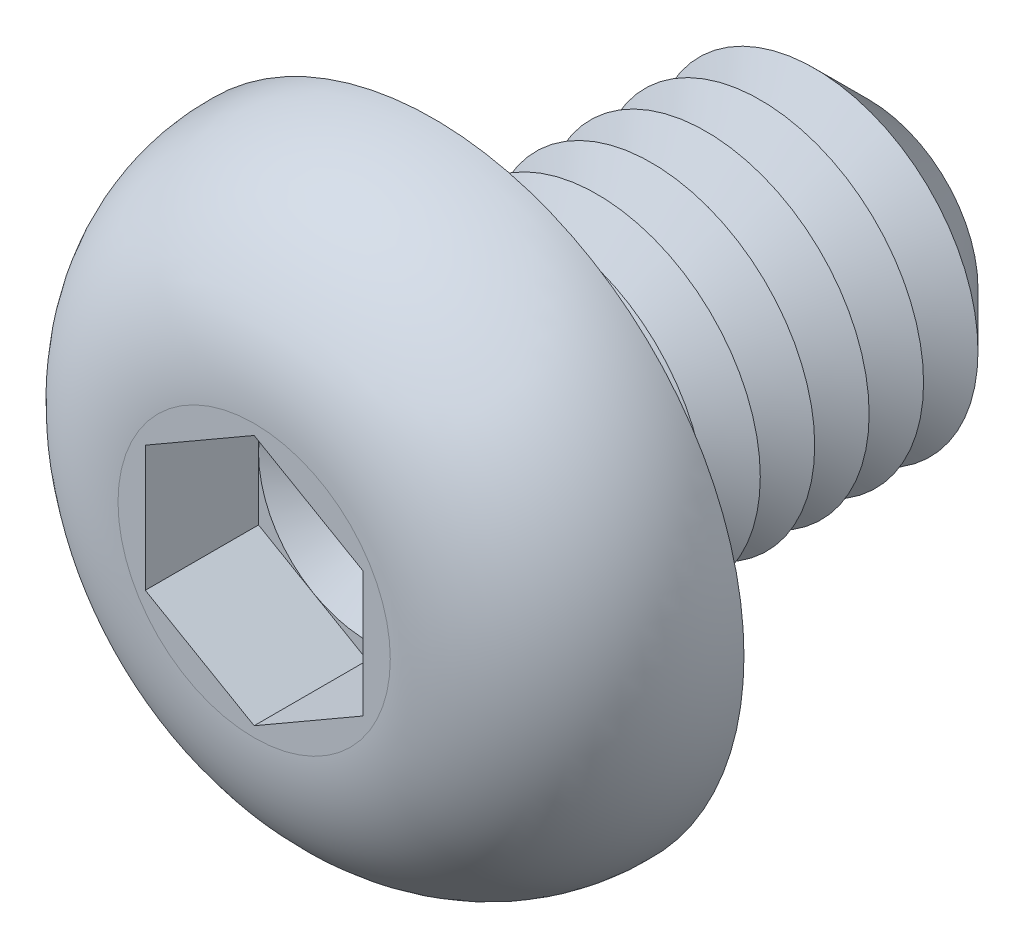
ISO-10303-21;
HEADER;
FILE_DESCRIPTION(('STEP AP214'),'2;1');
FILE_NAME('part.step','',(''),(''),'','','');
FILE_SCHEMA(('AUTOMOTIVE_DESIGN { 1 0 10303 214 1 1 1 1 }'));
ENDSEC;
DATA;
#1=APPLICATION_CONTEXT('core data for automotive mechanical design processes');
#2=APPLICATION_PROTOCOL_DEFINITION('international standard','automotive_design',2000,#1);
#3=PRODUCT_CONTEXT('',#1,'mechanical');
#4=PRODUCT('Part','Part','',(#3));
#5=PRODUCT_RELATED_PRODUCT_CATEGORY('part','',(#4));
#6=PRODUCT_DEFINITION_FORMATION('','',#4);
#7=PRODUCT_DEFINITION_CONTEXT('part definition',#1,'design');
#8=PRODUCT_DEFINITION('design','',#6,#7);
#9=PRODUCT_DEFINITION_SHAPE('','',#8);
#10=(LENGTH_UNIT() NAMED_UNIT(*) SI_UNIT(.MILLI.,.METRE.));
#11=(NAMED_UNIT(*) PLANE_ANGLE_UNIT() SI_UNIT($,.RADIAN.));
#12=(NAMED_UNIT(*) SI_UNIT($,.STERADIAN.) SOLID_ANGLE_UNIT());
#13=UNCERTAINTY_MEASURE_WITH_UNIT(LENGTH_MEASURE(1.E-05),#10,'distance_accuracy_value','');
#14=(GEOMETRIC_REPRESENTATION_CONTEXT(3) GLOBAL_UNCERTAINTY_ASSIGNED_CONTEXT((#13)) GLOBAL_UNIT_ASSIGNED_CONTEXT((#10,
#11,#12)) REPRESENTATION_CONTEXT('',''));
#15=CARTESIAN_POINT('',(0.,0.,0.));
#16=DIRECTION('',(0.,0.,1.));
#17=DIRECTION('',(1.,0.,0.));
#18=AXIS2_PLACEMENT_3D('',#15,#16,#17);
#19=CARTESIAN_POINT('',(0.,0.,0.61));
#20=DIRECTION('',(0.,0.,1.));
#21=DIRECTION('',(1.,0.,0.));
#22=AXIS2_PLACEMENT_3D('',#19,#20,#21);
#23=PLANE('',#22);
#24=CARTESIAN_POINT('',(0.,0.,0.61));
#25=DIRECTION('',(0.,0.,1.));
#26=DIRECTION('',(1.,0.,0.));
#27=AXIS2_PLACEMENT_3D('',#24,#25,#26);
#28=CIRCLE('',#27,1.);
#29=CARTESIAN_POINT('',(1.,0.,0.61));
#30=VERTEX_POINT('',#29);
#31=CARTESIAN_POINT('',(0.5,0.866025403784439,0.61));
#32=VERTEX_POINT('',#31);
#33=EDGE_CURVE('E117',#30,#32,#28,.T.);
#34=ORIENTED_EDGE('',*,*,#33,.F.);
#35=DIRECTION('',(0.,1.,0.));
#36=VECTOR('',#35,1.);
#37=CARTESIAN_POINT('',(1.,-0.577350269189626,0.61));
#38=LINE('',#37,#36);
#39=CARTESIAN_POINT('',(1.,0.577350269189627,0.61));
#40=VERTEX_POINT('',#39);
#41=EDGE_CURVE('E140',#30,#40,#38,.T.);
#42=ORIENTED_EDGE('',*,*,#41,.T.);
#43=DIRECTION('',(-0.866025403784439,0.5,0.));
#44=VECTOR('',#43,1.);
#45=CARTESIAN_POINT('',(1.,0.577350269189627,0.61));
#46=LINE('',#45,#44);
#47=EDGE_CURVE('E135',#40,#32,#46,.T.);
#48=ORIENTED_EDGE('',*,*,#47,.T.);
#49=EDGE_LOOP('',(#34,#42,#48));
#50=FACE_BOUND('',#49,.T.);
#51=ADVANCED_FACE('F39',(#50),#23,.T.);
#52=CARTESIAN_POINT('',(0.,0.,0.61));
#53=DIRECTION('',(0.,0.,1.));
#54=DIRECTION('',(1.,0.,0.));
#55=AXIS2_PLACEMENT_3D('',#52,#53,#54);
#56=CIRCLE('',#55,1.);
#57=CARTESIAN_POINT('',(-0.5,0.866025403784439,0.61));
#58=VERTEX_POINT('',#57);
#59=EDGE_CURVE('E11',#32,#58,#56,.T.);
#60=ORIENTED_EDGE('',*,*,#59,.F.);
#61=CARTESIAN_POINT('',(0.,1.15470053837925,0.61));
#62=VERTEX_POINT('',#61);
#63=EDGE_CURVE('E130',#32,#62,#46,.T.);
#64=ORIENTED_EDGE('',*,*,#63,.T.);
#65=DIRECTION('',(-0.866025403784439,-0.5,0.));
#66=VECTOR('',#65,1.);
#67=CARTESIAN_POINT('',(0.,1.15470053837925,0.61));
#68=LINE('',#67,#66);
#69=EDGE_CURVE('E132',#62,#58,#68,.T.);
#70=ORIENTED_EDGE('',*,*,#69,.T.);
#71=EDGE_LOOP('',(#60,#64,#70));
#72=FACE_BOUND('',#71,.T.);
#73=ADVANCED_FACE('F129',(#72),#23,.T.);
#74=CARTESIAN_POINT('',(-1.,0.,0.61));
#75=VERTEX_POINT('',#74);
#76=EDGE_CURVE('E49',#58,#75,#56,.T.);
#77=ORIENTED_EDGE('',*,*,#76,.F.);
#78=CARTESIAN_POINT('',(-1.,0.577350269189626,0.61));
#79=VERTEX_POINT('',#78);
#80=EDGE_CURVE('E143',#58,#79,#68,.T.);
#81=ORIENTED_EDGE('',*,*,#80,.T.);
#82=DIRECTION('',(0.,-1.,0.));
#83=VECTOR('',#82,1.);
#84=CARTESIAN_POINT('',(-1.,0.577350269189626,0.61));
#85=LINE('',#84,#83);
#86=EDGE_CURVE('E153',#79,#75,#85,.T.);
#87=ORIENTED_EDGE('',*,*,#86,.T.);
#88=EDGE_LOOP('',(#77,#81,#87));
#89=FACE_BOUND('',#88,.T.);
#90=ADVANCED_FACE('F248',(#89),#23,.T.);
#91=CARTESIAN_POINT('',(-0.5,-0.866025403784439,0.61));
#92=VERTEX_POINT('',#91);
#93=EDGE_CURVE('E232',#75,#92,#56,.T.);
#94=ORIENTED_EDGE('',*,*,#93,.F.);
#95=CARTESIAN_POINT('',(-1.,-0.577350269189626,0.61));
#96=VERTEX_POINT('',#95);
#97=EDGE_CURVE('E152',#75,#96,#85,.T.);
#98=ORIENTED_EDGE('',*,*,#97,.T.);
#99=DIRECTION('',(0.866025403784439,-0.5,0.));
#100=VECTOR('',#99,1.);
#101=CARTESIAN_POINT('',(-1.,-0.577350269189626,0.61));
#102=LINE('',#101,#100);
#103=EDGE_CURVE('E158',#96,#92,#102,.T.);
#104=ORIENTED_EDGE('',*,*,#103,.T.);
#105=EDGE_LOOP('',(#94,#98,#104));
#106=FACE_BOUND('',#105,.T.);
#107=ADVANCED_FACE('F241',(#106),#23,.T.);
#108=CARTESIAN_POINT('',(0.5,-0.866025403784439,0.61));
#109=VERTEX_POINT('',#108);
#110=EDGE_CURVE('E56',#92,#109,#56,.T.);
#111=ORIENTED_EDGE('',*,*,#110,.F.);
#112=CARTESIAN_POINT('',(0.,-1.15470053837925,0.61));
#113=VERTEX_POINT('',#112);
#114=EDGE_CURVE('E157',#92,#113,#102,.T.);
#115=ORIENTED_EDGE('',*,*,#114,.T.);
#116=DIRECTION('',(0.866025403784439,0.5,0.));
#117=VECTOR('',#116,1.);
#118=CARTESIAN_POINT('',(0.,-1.15470053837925,0.61));
#119=LINE('',#118,#117);
#120=EDGE_CURVE('E163',#113,#109,#119,.T.);
#121=ORIENTED_EDGE('',*,*,#120,.T.);
#122=EDGE_LOOP('',(#111,#115,#121));
#123=FACE_BOUND('',#122,.T.);
#124=ADVANCED_FACE('F320',(#123),#23,.T.);
#125=CARTESIAN_POINT('',(0.,0.,-4.));
#126=DIRECTION('',(0.,0.,1.));
#127=DIRECTION('',(1.,0.,0.));
#128=AXIS2_PLACEMENT_3D('',#125,#126,#127);
#129=CYLINDRICAL_SURFACE('',#128,1.5);
#130=CARTESIAN_POINT('',(0.,0.,-0.2));
#131=DIRECTION('',(0.,0.,1.));
#132=DIRECTION('',(1.,0.,0.));
#133=AXIS2_PLACEMENT_3D('',#130,#131,#132);
#134=CIRCLE('',#133,1.5);
#135=CARTESIAN_POINT('',(1.5,0.,-0.2));
#136=VERTEX_POINT('',#135);
#137=EDGE_CURVE('E221',#136,#136,#134,.F.);
#138=ORIENTED_EDGE('',*,*,#137,.T.);
#139=EDGE_LOOP('',(#138));
#140=FACE_BOUND('',#139,.T.);
#141=CARTESIAN_POINT('',(0.,0.,-0.5));
#142=DIRECTION('',(0.,0.,1.));
#143=DIRECTION('',(1.,0.,0.));
#144=AXIS2_PLACEMENT_3D('',#141,#142,#143);
#145=CIRCLE('',#144,1.50000000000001);
#146=CARTESIAN_POINT('',(1.50000000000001,0.,-0.5));
#147=VERTEX_POINT('',#146);
#148=EDGE_CURVE('E149',#147,#147,#145,.T.);
#149=ORIENTED_EDGE('',*,*,#148,.T.);
#150=EDGE_LOOP('',(#149));
#151=FACE_BOUND('',#150,.T.);
#152=ADVANCED_FACE('F304',(#140,#151),#129,.T.);
#153=CARTESIAN_POINT('',(0.,2.85,0.));
#154=DIRECTION('',(0.,0.,1.));
#155=DIRECTION('',(1.,0.,0.));
#156=AXIS2_PLACEMENT_3D('',#153,#154,#155);
#157=PLANE('',#156);
#158=CARTESIAN_POINT('',(0.,0.,0.));
#159=DIRECTION('',(0.,0.,1.));
#160=DIRECTION('',(1.,0.,0.));
#161=AXIS2_PLACEMENT_3D('',#158,#159,#160);
#162=CIRCLE('',#161,1.7);
#163=CARTESIAN_POINT('',(1.7,0.,0.));
#164=VERTEX_POINT('',#163);
#165=EDGE_CURVE('E224',#164,#164,#162,.T.);
#166=ORIENTED_EDGE('',*,*,#165,.T.);
#167=EDGE_LOOP('',(#166));
#168=FACE_BOUND('',#167,.T.);
#169=CARTESIAN_POINT('',(0.,0.,0.));
#170=DIRECTION('',(0.,0.,1.));
#171=DIRECTION('',(1.,0.,0.));
#172=AXIS2_PLACEMENT_3D('',#169,#170,#171);
#173=CIRCLE('',#172,2.85);
#174=CARTESIAN_POINT('',(2.85,0.,0.));
#175=VERTEX_POINT('',#174);
#176=EDGE_CURVE('E195',#175,#175,#173,.T.);
#177=ORIENTED_EDGE('',*,*,#176,.F.);
#178=EDGE_LOOP('',(#177));
#179=FACE_BOUND('',#178,.T.);
#180=ADVANCED_FACE('F350',(#168,#179),#157,.F.);
#181=CARTESIAN_POINT('',(0.,0.,1.65));
#182=DIRECTION('',(0.,0.,-1.));
#183=DIRECTION('',(-1.,0.,0.));
#184=AXIS2_PLACEMENT_3D('',#181,#182,#183);
#185=PLANE('',#184);
#186=DIRECTION('',(-0.866025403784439,-0.5,0.));
#187=VECTOR('',#186,1.);
#188=CARTESIAN_POINT('',(0.,1.15470053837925,1.65));
#189=LINE('',#188,#187);
#190=CARTESIAN_POINT('',(0.,1.15470053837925,1.65));
#191=VERTEX_POINT('',#190);
#192=CARTESIAN_POINT('',(-1.,0.577350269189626,1.65));
#193=VERTEX_POINT('',#192);
#194=EDGE_CURVE('E173',#191,#193,#189,.T.);
#195=ORIENTED_EDGE('',*,*,#194,.F.);
#196=DIRECTION('',(-0.866025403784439,0.5,0.));
#197=VECTOR('',#196,1.);
#198=CARTESIAN_POINT('',(1.,0.577350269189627,1.65));
#199=LINE('',#198,#197);
#200=CARTESIAN_POINT('',(1.,0.577350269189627,1.65));
#201=VERTEX_POINT('',#200);
#202=EDGE_CURVE('E64',#201,#191,#199,.T.);
#203=ORIENTED_EDGE('',*,*,#202,.F.);
#204=DIRECTION('',(0.,1.,0.));
#205=VECTOR('',#204,1.);
#206=CARTESIAN_POINT('',(1.,-0.577350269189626,1.65));
#207=LINE('',#206,#205);
#208=CARTESIAN_POINT('',(1.,-0.577350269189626,1.65));
#209=VERTEX_POINT('',#208);
#210=EDGE_CURVE('E138',#209,#201,#207,.T.);
#211=ORIENTED_EDGE('',*,*,#210,.F.);
#212=DIRECTION('',(0.866025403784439,0.5,0.));
#213=VECTOR('',#212,1.);
#214=CARTESIAN_POINT('',(0.,-1.15470053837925,1.65));
#215=LINE('',#214,#213);
#216=CARTESIAN_POINT('',(0.,-1.15470053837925,1.65));
#217=VERTEX_POINT('',#216);
#218=EDGE_CURVE('E185',#217,#209,#215,.T.);
#219=ORIENTED_EDGE('',*,*,#218,.F.);
#220=DIRECTION('',(0.866025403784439,-0.5,0.));
#221=VECTOR('',#220,1.);
#222=CARTESIAN_POINT('',(-1.,-0.577350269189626,1.65));
#223=LINE('',#222,#221);
#224=CARTESIAN_POINT('',(-1.,-0.577350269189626,1.65));
#225=VERTEX_POINT('',#224);
#226=EDGE_CURVE('E181',#225,#217,#223,.T.);
#227=ORIENTED_EDGE('',*,*,#226,.F.);
#228=DIRECTION('',(0.,-1.,0.));
#229=VECTOR('',#228,1.);
#230=CARTESIAN_POINT('',(-1.,0.577350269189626,1.65));
#231=LINE('',#230,#229);
#232=EDGE_CURVE('E177',#193,#225,#231,.T.);
#233=ORIENTED_EDGE('',*,*,#232,.F.);
#234=EDGE_LOOP('',(#195,#203,#211,#219,#227,#233));
#235=FACE_BOUND('',#234,.T.);
#236=CARTESIAN_POINT('',(0.,0.,1.65));
#237=DIRECTION('',(0.,0.,1.));
#238=DIRECTION('',(1.,0.,0.));
#239=AXIS2_PLACEMENT_3D('',#236,#237,#238);
#240=CIRCLE('',#239,1.25078144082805);
#241=CARTESIAN_POINT('',(1.25078144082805,0.,1.65));
#242=VERTEX_POINT('',#241);
#243=EDGE_CURVE('E213',#242,#242,#240,.T.);
#244=ORIENTED_EDGE('',*,*,#243,.T.);
#245=EDGE_LOOP('',(#244));
#246=FACE_BOUND('',#245,.T.);
#247=ADVANCED_FACE('F257',(#235,#246),#185,.F.);
#248=CARTESIAN_POINT('',(0.,0.,0.0499999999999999));
#249=DIRECTION('',(0.,0.,1.));
#250=DIRECTION('',(1.,0.,0.));
#251=AXIS2_PLACEMENT_3D('',#248,#249,#250);
#252=DEGENERATE_TOROIDAL_SURFACE('',#251,1.25078144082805,1.6,.T.);
#253=ORIENTED_EDGE('',*,*,#243,.F.);
#254=EDGE_LOOP('',(#253));
#255=FACE_BOUND('',#254,.T.);
#256=ORIENTED_EDGE('',*,*,#176,.T.);
#257=EDGE_LOOP('',(#256));
#258=FACE_BOUND('',#257,.T.);
#259=ADVANCED_FACE('F344',(#255,#258),#252,.T.);
#260=CARTESIAN_POINT('',(1.,0.577350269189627,0.61));
#261=DIRECTION('',(0.5,0.866025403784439,0.));
#262=DIRECTION('',(-0.866025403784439,0.5,0.));
#263=AXIS2_PLACEMENT_3D('',#260,#261,#262);
#264=PLANE('',#263);
#265=ORIENTED_EDGE('',*,*,#202,.T.);
#266=DIRECTION('',(0.,0.,1.));
#267=VECTOR('',#266,1.);
#268=CARTESIAN_POINT('',(0.,1.15470053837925,0.61));
#269=LINE('',#268,#267);
#270=EDGE_CURVE('E136',#62,#191,#269,.T.);
#271=ORIENTED_EDGE('',*,*,#270,.F.);
#272=ORIENTED_EDGE('',*,*,#63,.F.);
#273=ORIENTED_EDGE('',*,*,#47,.F.);
#274=DIRECTION('',(0.,0.,1.));
#275=VECTOR('',#274,1.);
#276=CARTESIAN_POINT('',(1.,0.577350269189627,0.61));
#277=LINE('',#276,#275);
#278=EDGE_CURVE('E192',#40,#201,#277,.T.);
#279=ORIENTED_EDGE('',*,*,#278,.T.);
#280=EDGE_LOOP('',(#265,#271,#272,#273,#279));
#281=FACE_BOUND('',#280,.T.);
#282=ADVANCED_FACE('F134',(#281),#264,.F.);
#283=CARTESIAN_POINT('',(1.,-0.577350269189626,0.61));
#284=DIRECTION('',(1.,0.,0.));
#285=DIRECTION('',(0.,0.,-1.));
#286=AXIS2_PLACEMENT_3D('',#283,#284,#285);
#287=PLANE('',#286);
#288=ORIENTED_EDGE('',*,*,#210,.T.);
#289=ORIENTED_EDGE('',*,*,#278,.F.);
#290=ORIENTED_EDGE('',*,*,#41,.F.);
#291=CARTESIAN_POINT('',(1.,-0.577350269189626,0.61));
#292=VERTEX_POINT('',#291);
#293=EDGE_CURVE('E167',#292,#30,#38,.T.);
#294=ORIENTED_EDGE('',*,*,#293,.F.);
#295=DIRECTION('',(0.,0.,1.));
#296=VECTOR('',#295,1.);
#297=CARTESIAN_POINT('',(1.,-0.577350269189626,0.61));
#298=LINE('',#297,#296);
#299=EDGE_CURVE('E196',#292,#209,#298,.T.);
#300=ORIENTED_EDGE('',*,*,#299,.T.);
#301=EDGE_LOOP('',(#288,#289,#290,#294,#300));
#302=FACE_BOUND('',#301,.T.);
#303=ADVANCED_FACE('F328',(#302),#287,.F.);
#304=CARTESIAN_POINT('',(0.,-1.15470053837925,0.61));
#305=DIRECTION('',(0.5,-0.866025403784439,0.));
#306=DIRECTION('',(0.866025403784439,0.5,0.));
#307=AXIS2_PLACEMENT_3D('',#304,#305,#306);
#308=PLANE('',#307);
#309=ORIENTED_EDGE('',*,*,#218,.T.);
#310=ORIENTED_EDGE('',*,*,#299,.F.);
#311=EDGE_CURVE('E162',#109,#292,#119,.T.);
#312=ORIENTED_EDGE('',*,*,#311,.F.);
#313=ORIENTED_EDGE('',*,*,#120,.F.);
#314=DIRECTION('',(0.,0.,1.));
#315=VECTOR('',#314,1.);
#316=CARTESIAN_POINT('',(0.,-1.15470053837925,0.61));
#317=LINE('',#316,#315);
#318=EDGE_CURVE('E199',#113,#217,#317,.T.);
#319=ORIENTED_EDGE('',*,*,#318,.T.);
#320=EDGE_LOOP('',(#309,#310,#312,#313,#319));
#321=FACE_BOUND('',#320,.T.);
#322=ADVANCED_FACE('F331',(#321),#308,.F.);
#323=CARTESIAN_POINT('',(-1.,-0.577350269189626,0.61));
#324=DIRECTION('',(-0.5,-0.866025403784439,0.));
#325=DIRECTION('',(0.866025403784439,-0.5,0.));
#326=AXIS2_PLACEMENT_3D('',#323,#324,#325);
#327=PLANE('',#326);
#328=ORIENTED_EDGE('',*,*,#226,.T.);
#329=ORIENTED_EDGE('',*,*,#318,.F.);
#330=ORIENTED_EDGE('',*,*,#114,.F.);
#331=ORIENTED_EDGE('',*,*,#103,.F.);
#332=DIRECTION('',(0.,0.,1.));
#333=VECTOR('',#332,1.);
#334=CARTESIAN_POINT('',(-1.,-0.577350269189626,0.61));
#335=LINE('',#334,#333);
#336=EDGE_CURVE('E202',#96,#225,#335,.T.);
#337=ORIENTED_EDGE('',*,*,#336,.T.);
#338=EDGE_LOOP('',(#328,#329,#330,#331,#337));
#339=FACE_BOUND('',#338,.T.);
#340=ADVANCED_FACE('F262',(#339),#327,.F.);
#341=CARTESIAN_POINT('',(-1.,0.577350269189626,0.61));
#342=DIRECTION('',(-1.,0.,0.));
#343=DIRECTION('',(0.,-1.,0.));
#344=AXIS2_PLACEMENT_3D('',#341,#342,#343);
#345=PLANE('',#344);
#346=ORIENTED_EDGE('',*,*,#232,.T.);
#347=ORIENTED_EDGE('',*,*,#336,.F.);
#348=ORIENTED_EDGE('',*,*,#97,.F.);
#349=ORIENTED_EDGE('',*,*,#86,.F.);
#350=DIRECTION('',(0.,0.,1.));
#351=VECTOR('',#350,1.);
#352=CARTESIAN_POINT('',(-1.,0.577350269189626,0.61));
#353=LINE('',#352,#351);
#354=EDGE_CURVE('E205',#79,#193,#353,.T.);
#355=ORIENTED_EDGE('',*,*,#354,.T.);
#356=EDGE_LOOP('',(#346,#347,#348,#349,#355));
#357=FACE_BOUND('',#356,.T.);
#358=ADVANCED_FACE('F246',(#357),#345,.F.);
#359=CARTESIAN_POINT('',(0.,1.15470053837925,0.61));
#360=DIRECTION('',(-0.5,0.866025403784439,0.));
#361=DIRECTION('',(-0.866025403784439,-0.5,0.));
#362=AXIS2_PLACEMENT_3D('',#359,#360,#361);
#363=PLANE('',#362);
#364=ORIENTED_EDGE('',*,*,#194,.T.);
#365=ORIENTED_EDGE('',*,*,#354,.F.);
#366=ORIENTED_EDGE('',*,*,#80,.F.);
#367=ORIENTED_EDGE('',*,*,#69,.F.);
#368=ORIENTED_EDGE('',*,*,#270,.T.);
#369=EDGE_LOOP('',(#364,#365,#366,#367,#368));
#370=FACE_BOUND('',#369,.T.);
#371=ADVANCED_FACE('F251',(#370),#363,.F.);
#372=EDGE_CURVE('E43',#109,#30,#56,.T.);
#373=ORIENTED_EDGE('',*,*,#372,.F.);
#374=ORIENTED_EDGE('',*,*,#311,.T.);
#375=ORIENTED_EDGE('',*,*,#293,.T.);
#376=EDGE_LOOP('',(#373,#374,#375));
#377=FACE_BOUND('',#376,.T.);
#378=ADVANCED_FACE('F309',(#377),#23,.T.);
#379=CARTESIAN_POINT('',(0.,0.,-0.5));
#380=DIRECTION('',(0.,0.,1.));
#381=DIRECTION('',(1.,0.,0.));
#382=AXIS2_PLACEMENT_3D('',#379,#380,#381);
#383=CONICAL_SURFACE('',#382,1.50000000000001,1.0471975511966);
#384=CARTESIAN_POINT('',(0.,0.,-0.750000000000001));
#385=DIRECTION('',(0.,0.,1.));
#386=DIRECTION('',(1.,0.,0.));
#387=AXIS2_PLACEMENT_3D('',#384,#385,#386);
#388=CIRCLE('',#387,1.06698729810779);
#389=CARTESIAN_POINT('',(1.06698729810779,0.,-0.750000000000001));
#390=VERTEX_POINT('',#389);
#391=EDGE_CURVE('E295',#390,#390,#388,.T.);
#392=ORIENTED_EDGE('',*,*,#391,.T.);
#393=EDGE_LOOP('',(#392));
#394=FACE_BOUND('',#393,.T.);
#395=ORIENTED_EDGE('',*,*,#148,.F.);
#396=EDGE_LOOP('',(#395));
#397=FACE_BOUND('',#396,.T.);
#398=ADVANCED_FACE('F306',(#394,#397),#383,.T.);
#399=CARTESIAN_POINT('',(0.,0.,-0.750000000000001));
#400=DIRECTION('',(0.,0.,-1.));
#401=DIRECTION('',(-1.,0.,0.));
#402=AXIS2_PLACEMENT_3D('',#399,#400,#401);
#403=CONICAL_SURFACE('',#402,1.06698729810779,1.0471975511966);
#404=CARTESIAN_POINT('',(0.,0.,-1.));
#405=DIRECTION('',(0.,0.,1.));
#406=DIRECTION('',(1.,0.,0.));
#407=AXIS2_PLACEMENT_3D('',#404,#405,#406);
#408=CIRCLE('',#407,1.50000000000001);
#409=CARTESIAN_POINT('',(1.50000000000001,0.,-1.));
#410=VERTEX_POINT('',#409);
#411=EDGE_CURVE('E286',#410,#410,#408,.T.);
#412=ORIENTED_EDGE('',*,*,#411,.T.);
#413=EDGE_LOOP('',(#412));
#414=FACE_BOUND('',#413,.T.);
#415=ORIENTED_EDGE('',*,*,#391,.F.);
#416=EDGE_LOOP('',(#415));
#417=FACE_BOUND('',#416,.T.);
#418=ADVANCED_FACE('F308',(#414,#417),#403,.T.);
#419=CARTESIAN_POINT('',(0.,0.,-1.));
#420=DIRECTION('',(0.,0.,1.));
#421=DIRECTION('',(1.,0.,0.));
#422=AXIS2_PLACEMENT_3D('',#419,#420,#421);
#423=CONICAL_SURFACE('',#422,1.50000000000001,1.0471975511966);
#424=CARTESIAN_POINT('',(0.,0.,-1.25));
#425=DIRECTION('',(0.,0.,1.));
#426=DIRECTION('',(1.,0.,0.));
#427=AXIS2_PLACEMENT_3D('',#424,#425,#426);
#428=CIRCLE('',#427,1.06698729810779);
#429=CARTESIAN_POINT('',(1.06698729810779,0.,-1.25));
#430=VERTEX_POINT('',#429);
#431=EDGE_CURVE('E279',#430,#430,#428,.T.);
#432=ORIENTED_EDGE('',*,*,#431,.T.);
#433=EDGE_LOOP('',(#432));
#434=FACE_BOUND('',#433,.T.);
#435=ORIENTED_EDGE('',*,*,#411,.F.);
#436=EDGE_LOOP('',(#435));
#437=FACE_BOUND('',#436,.T.);
#438=ADVANCED_FACE('F315',(#434,#437),#423,.T.);
#439=CARTESIAN_POINT('',(0.,0.,-1.25));
#440=DIRECTION('',(0.,0.,-1.));
#441=DIRECTION('',(-1.,0.,0.));
#442=AXIS2_PLACEMENT_3D('',#439,#440,#441);
#443=CONICAL_SURFACE('',#442,1.06698729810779,1.0471975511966);
#444=CARTESIAN_POINT('',(0.,0.,-1.5));
#445=DIRECTION('',(0.,0.,1.));
#446=DIRECTION('',(1.,0.,0.));
#447=AXIS2_PLACEMENT_3D('',#444,#445,#446);
#448=CIRCLE('',#447,1.50000000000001);
#449=CARTESIAN_POINT('',(1.50000000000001,0.,-1.5));
#450=VERTEX_POINT('',#449);
#451=EDGE_CURVE('E277',#450,#450,#448,.T.);
#452=ORIENTED_EDGE('',*,*,#451,.T.);
#453=EDGE_LOOP('',(#452));
#454=FACE_BOUND('',#453,.T.);
#455=ORIENTED_EDGE('',*,*,#431,.F.);
#456=EDGE_LOOP('',(#455));
#457=FACE_BOUND('',#456,.T.);
#458=ADVANCED_FACE('F406',(#454,#457),#443,.T.);
#459=CARTESIAN_POINT('',(0.,0.,-1.5));
#460=DIRECTION('',(0.,0.,1.));
#461=DIRECTION('',(1.,0.,0.));
#462=AXIS2_PLACEMENT_3D('',#459,#460,#461);
#463=CONICAL_SURFACE('',#462,1.50000000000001,1.0471975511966);
#464=CARTESIAN_POINT('',(0.,0.,-1.75));
#465=DIRECTION('',(0.,0.,1.));
#466=DIRECTION('',(1.,0.,0.));
#467=AXIS2_PLACEMENT_3D('',#464,#465,#466);
#468=CIRCLE('',#467,1.06698729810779);
#469=CARTESIAN_POINT('',(1.06698729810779,0.,-1.75));
#470=VERTEX_POINT('',#469);
#471=EDGE_CURVE('E280',#470,#470,#468,.T.);
#472=ORIENTED_EDGE('',*,*,#471,.T.);
#473=EDGE_LOOP('',(#472));
#474=FACE_BOUND('',#473,.T.);
#475=ORIENTED_EDGE('',*,*,#451,.F.);
#476=EDGE_LOOP('',(#475));
#477=FACE_BOUND('',#476,.T.);
#478=ADVANCED_FACE('F400',(#474,#477),#463,.T.);
#479=CARTESIAN_POINT('',(0.,0.,-1.75));
#480=DIRECTION('',(0.,0.,-1.));
#481=DIRECTION('',(-1.,0.,0.));
#482=AXIS2_PLACEMENT_3D('',#479,#480,#481);
#483=CONICAL_SURFACE('',#482,1.06698729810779,1.0471975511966);
#484=CARTESIAN_POINT('',(0.,0.,-2.));
#485=DIRECTION('',(0.,0.,1.));
#486=DIRECTION('',(1.,0.,0.));
#487=AXIS2_PLACEMENT_3D('',#484,#485,#486);
#488=CIRCLE('',#487,1.50000000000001);
#489=CARTESIAN_POINT('',(1.50000000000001,0.,-2.));
#490=VERTEX_POINT('',#489);
#491=EDGE_CURVE('E289',#490,#490,#488,.T.);
#492=ORIENTED_EDGE('',*,*,#491,.T.);
#493=EDGE_LOOP('',(#492));
#494=FACE_BOUND('',#493,.T.);
#495=ORIENTED_EDGE('',*,*,#471,.F.);
#496=EDGE_LOOP('',(#495));
#497=FACE_BOUND('',#496,.T.);
#498=ADVANCED_FACE('F385',(#494,#497),#483,.T.);
#499=CARTESIAN_POINT('',(0.,0.,-2.));
#500=DIRECTION('',(0.,0.,1.));
#501=DIRECTION('',(1.,0.,0.));
#502=AXIS2_PLACEMENT_3D('',#499,#500,#501);
#503=CONICAL_SURFACE('',#502,1.50000000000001,1.0471975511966);
#504=CARTESIAN_POINT('',(0.,0.,-2.25));
#505=DIRECTION('',(0.,0.,1.));
#506=DIRECTION('',(1.,0.,0.));
#507=AXIS2_PLACEMENT_3D('',#504,#505,#506);
#508=CIRCLE('',#507,1.06698729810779);
#509=CARTESIAN_POINT('',(1.06698729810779,0.,-2.25));
#510=VERTEX_POINT('',#509);
#511=EDGE_CURVE('E273',#510,#510,#508,.T.);
#512=ORIENTED_EDGE('',*,*,#511,.T.);
#513=EDGE_LOOP('',(#512));
#514=FACE_BOUND('',#513,.T.);
#515=ORIENTED_EDGE('',*,*,#491,.F.);
#516=EDGE_LOOP('',(#515));
#517=FACE_BOUND('',#516,.T.);
#518=ADVANCED_FACE('F388',(#514,#517),#503,.T.);
#519=CARTESIAN_POINT('',(0.,0.,-2.25));
#520=DIRECTION('',(0.,0.,-1.));
#521=DIRECTION('',(-1.,0.,0.));
#522=AXIS2_PLACEMENT_3D('',#519,#520,#521);
#523=CONICAL_SURFACE('',#522,1.06698729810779,1.0471975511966);
#524=CARTESIAN_POINT('',(0.,0.,-2.5));
#525=DIRECTION('',(0.,0.,1.));
#526=DIRECTION('',(1.,0.,0.));
#527=AXIS2_PLACEMENT_3D('',#524,#525,#526);
#528=CIRCLE('',#527,1.50000000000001);
#529=CARTESIAN_POINT('',(1.50000000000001,0.,-2.5));
#530=VERTEX_POINT('',#529);
#531=EDGE_CURVE('E270',#530,#530,#528,.T.);
#532=ORIENTED_EDGE('',*,*,#531,.T.);
#533=EDGE_LOOP('',(#532));
#534=FACE_BOUND('',#533,.T.);
#535=ORIENTED_EDGE('',*,*,#511,.F.);
#536=EDGE_LOOP('',(#535));
#537=FACE_BOUND('',#536,.T.);
#538=ADVANCED_FACE('F390',(#534,#537),#523,.T.);
#539=CARTESIAN_POINT('',(0.,0.,-2.5));
#540=DIRECTION('',(0.,0.,1.));
#541=DIRECTION('',(1.,0.,0.));
#542=AXIS2_PLACEMENT_3D('',#539,#540,#541);
#543=CONICAL_SURFACE('',#542,1.50000000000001,1.0471975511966);
#544=CARTESIAN_POINT('',(0.,0.,-2.75));
#545=DIRECTION('',(0.,0.,1.));
#546=DIRECTION('',(1.,0.,0.));
#547=AXIS2_PLACEMENT_3D('',#544,#545,#546);
#548=CIRCLE('',#547,1.06698729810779);
#549=CARTESIAN_POINT('',(1.06698729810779,0.,-2.75));
#550=VERTEX_POINT('',#549);
#551=EDGE_CURVE('E268',#550,#550,#548,.T.);
#552=ORIENTED_EDGE('',*,*,#551,.T.);
#553=EDGE_LOOP('',(#552));
#554=FACE_BOUND('',#553,.T.);
#555=ORIENTED_EDGE('',*,*,#531,.F.);
#556=EDGE_LOOP('',(#555));
#557=FACE_BOUND('',#556,.T.);
#558=ADVANCED_FACE('F397',(#554,#557),#543,.T.);
#559=CARTESIAN_POINT('',(0.,0.,-2.75));
#560=DIRECTION('',(0.,0.,-1.));
#561=DIRECTION('',(-1.,0.,0.));
#562=AXIS2_PLACEMENT_3D('',#559,#560,#561);
#563=CONICAL_SURFACE('',#562,1.06698729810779,1.0471975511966);
#564=CARTESIAN_POINT('',(0.,0.,-3.));
#565=DIRECTION('',(0.,0.,1.));
#566=DIRECTION('',(1.,0.,0.));
#567=AXIS2_PLACEMENT_3D('',#564,#565,#566);
#568=CIRCLE('',#567,1.50000000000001);
#569=CARTESIAN_POINT('',(1.50000000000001,0.,-3.));
#570=VERTEX_POINT('',#569);
#571=EDGE_CURVE('E370',#570,#570,#568,.T.);
#572=ORIENTED_EDGE('',*,*,#571,.T.);
#573=EDGE_LOOP('',(#572));
#574=FACE_BOUND('',#573,.T.);
#575=ORIENTED_EDGE('',*,*,#551,.F.);
#576=EDGE_LOOP('',(#575));
#577=FACE_BOUND('',#576,.T.);
#578=ADVANCED_FACE('F445',(#574,#577),#563,.T.);
#579=CARTESIAN_POINT('',(0.,0.,-3.));
#580=DIRECTION('',(0.,0.,1.));
#581=DIRECTION('',(1.,0.,0.));
#582=AXIS2_PLACEMENT_3D('',#579,#580,#581);
#583=CONICAL_SURFACE('',#582,1.50000000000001,1.0471975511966);
#584=CARTESIAN_POINT('',(0.,0.,-3.25));
#585=DIRECTION('',(0.,0.,1.));
#586=DIRECTION('',(1.,0.,0.));
#587=AXIS2_PLACEMENT_3D('',#584,#585,#586);
#588=CIRCLE('',#587,1.06698729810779);
#589=CARTESIAN_POINT('',(1.06698729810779,0.,-3.25));
#590=VERTEX_POINT('',#589);
#591=EDGE_CURVE('E124',#590,#590,#588,.T.);
#592=ORIENTED_EDGE('',*,*,#591,.T.);
#593=EDGE_LOOP('',(#592));
#594=FACE_BOUND('',#593,.T.);
#595=ORIENTED_EDGE('',*,*,#571,.F.);
#596=EDGE_LOOP('',(#595));
#597=FACE_BOUND('',#596,.T.);
#598=ADVANCED_FACE('F453',(#594,#597),#583,.T.);
#599=CARTESIAN_POINT('',(0.,0.,-3.25));
#600=DIRECTION('',(0.,0.,-1.));
#601=DIRECTION('',(-1.,0.,0.));
#602=AXIS2_PLACEMENT_3D('',#599,#600,#601);
#603=CONICAL_SURFACE('',#602,1.06698729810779,1.0471975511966);
#604=CARTESIAN_POINT('',(0.,0.,-3.5));
#605=DIRECTION('',(0.,0.,1.));
#606=DIRECTION('',(1.,0.,0.));
#607=AXIS2_PLACEMENT_3D('',#604,#605,#606);
#608=CIRCLE('',#607,1.50000000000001);
#609=CARTESIAN_POINT('',(1.50000000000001,0.,-3.5));
#610=VERTEX_POINT('',#609);
#611=EDGE_CURVE('E366',#610,#610,#608,.T.);
#612=ORIENTED_EDGE('',*,*,#611,.T.);
#613=EDGE_LOOP('',(#612));
#614=FACE_BOUND('',#613,.T.);
#615=ORIENTED_EDGE('',*,*,#591,.F.);
#616=EDGE_LOOP('',(#615));
#617=FACE_BOUND('',#616,.T.);
#618=ADVANCED_FACE('F361',(#614,#617),#603,.T.);
#619=CARTESIAN_POINT('',(0.,0.,-4.));
#620=DIRECTION('',(0.,0.,-1.));
#621=DIRECTION('',(-1.,0.,0.));
#622=AXIS2_PLACEMENT_3D('',#619,#620,#621);
#623=PLANE('',#622);
#624=CARTESIAN_POINT('',(0.,0.,-4.));
#625=DIRECTION('',(0.,0.,-1.));
#626=DIRECTION('',(-1.,0.,0.));
#627=AXIS2_PLACEMENT_3D('',#624,#625,#626);
#628=CIRCLE('',#627,0.999999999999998);
#629=CARTESIAN_POINT('',(-0.999999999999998,0.,-4.));
#630=VERTEX_POINT('',#629);
#631=EDGE_CURVE('E217',#630,#630,#628,.T.);
#632=ORIENTED_EDGE('',*,*,#631,.T.);
#633=EDGE_LOOP('',(#632));
#634=FACE_BOUND('',#633,.T.);
#635=ADVANCED_FACE('F354',(#634),#623,.T.);
#636=CARTESIAN_POINT('',(0.,0.,-4.));
#637=DIRECTION('',(0.,0.,1.));
#638=DIRECTION('',(1.,0.,0.));
#639=AXIS2_PLACEMENT_3D('',#636,#637,#638);
#640=CONICAL_SURFACE('',#639,0.999999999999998,0.785398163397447);
#641=ORIENTED_EDGE('',*,*,#611,.F.);
#642=EDGE_LOOP('',(#641));
#643=FACE_BOUND('',#642,.T.);
#644=ORIENTED_EDGE('',*,*,#631,.F.);
#645=EDGE_LOOP('',(#644));
#646=FACE_BOUND('',#645,.T.);
#647=ADVANCED_FACE('F352',(#643,#646),#640,.T.);
#648=CARTESIAN_POINT('',(0.,0.,-0.2));
#649=DIRECTION('',(0.,0.,1.));
#650=DIRECTION('',(1.,0.,0.));
#651=AXIS2_PLACEMENT_3D('',#648,#649,#650);
#652=TOROIDAL_SURFACE('',#651,1.7,0.2);
#653=ORIENTED_EDGE('',*,*,#165,.F.);
#654=EDGE_LOOP('',(#653));
#655=FACE_BOUND('',#654,.T.);
#656=ORIENTED_EDGE('',*,*,#137,.F.);
#657=EDGE_LOOP('',(#656));
#658=FACE_BOUND('',#657,.T.);
#659=ADVANCED_FACE('F41',(#655,#658),#652,.F.);
#660=CARTESIAN_POINT('',(0.,0.,0.61));
#661=DIRECTION('',(0.,0.,1.));
#662=DIRECTION('',(1.,0.,0.));
#663=AXIS2_PLACEMENT_3D('',#660,#661,#662);
#664=CONICAL_SURFACE('',#663,1.,1.0471975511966);
#665=CARTESIAN_POINT('',(0.,0.,0.0326497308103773));
#666=VERTEX_POINT('',#665);
#667=VERTEX_LOOP('',#666);
#668=FACE_BOUND('',#667,.T.);
#669=ORIENTED_EDGE('',*,*,#33,.T.);
#670=ORIENTED_EDGE('',*,*,#59,.T.);
#671=ORIENTED_EDGE('',*,*,#76,.T.);
#672=ORIENTED_EDGE('',*,*,#93,.T.);
#673=ORIENTED_EDGE('',*,*,#110,.T.);
#674=ORIENTED_EDGE('',*,*,#372,.T.);
#675=EDGE_LOOP('',(#669,#670,#671,#672,#673,#674));
#676=FACE_BOUND('',#675,.T.);
#677=ADVANCED_FACE('F113',(#668,#676),#664,.F.);
#678=CLOSED_SHELL('',(#51,#73,#90,#107,#124,#152,#180,#247,#259,#282,#303,#322,#340,#358,#371,
#378,#398,#418,#438,#458,#478,#498,#518,#538,#558,#578,#598,#618,#635,#647,#659,#677));
#679=MANIFOLD_SOLID_BREP('B2',#678);
#680=ADVANCED_BREP_SHAPE_REPRESENTATION('',(#18,#679),#14);
#681=SHAPE_DEFINITION_REPRESENTATION(#9,#680);
ENDSEC;
END-ISO-10303-21;
